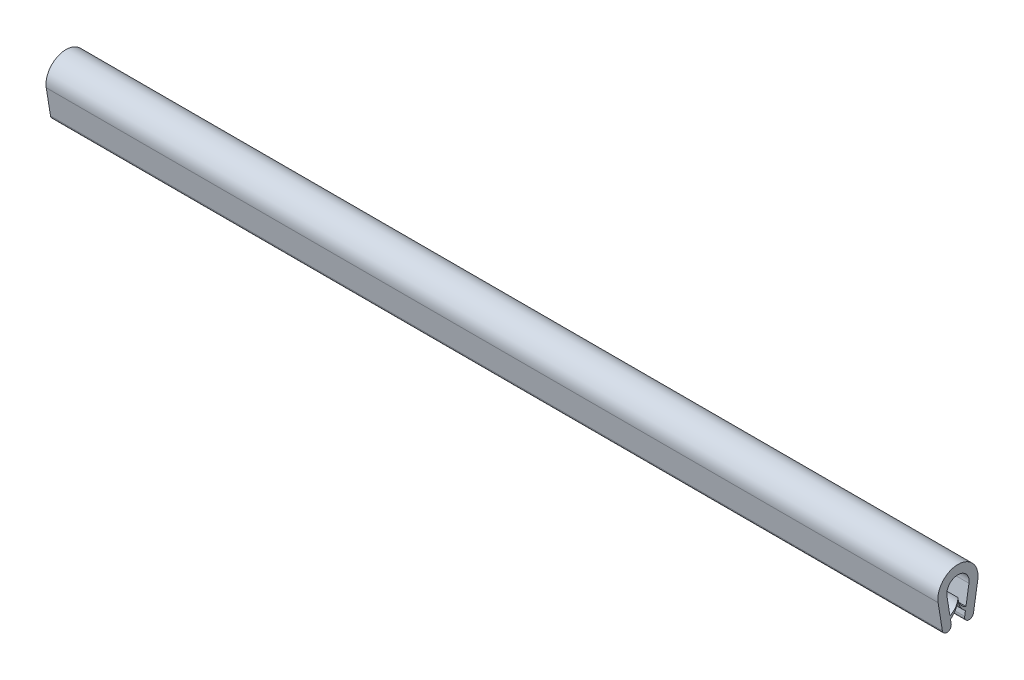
ISO-10303-21;
HEADER;
FILE_DESCRIPTION(('STEP AP214'),'2;1');
FILE_NAME('part.step','',(''),(''),'','','');
FILE_SCHEMA(('AUTOMOTIVE_DESIGN { 1 0 10303 214 1 1 1 1 }'));
ENDSEC;
DATA;
#1=APPLICATION_CONTEXT('core data for automotive mechanical design processes');
#2=APPLICATION_PROTOCOL_DEFINITION('international standard','automotive_design',2000,#1);
#3=PRODUCT_CONTEXT('',#1,'mechanical');
#4=PRODUCT('Part','Part','',(#3));
#5=PRODUCT_RELATED_PRODUCT_CATEGORY('part','',(#4));
#6=PRODUCT_DEFINITION_FORMATION('','',#4);
#7=PRODUCT_DEFINITION_CONTEXT('part definition',#1,'design');
#8=PRODUCT_DEFINITION('design','',#6,#7);
#9=PRODUCT_DEFINITION_SHAPE('','',#8);
#10=(LENGTH_UNIT() NAMED_UNIT(*) SI_UNIT(.MILLI.,.METRE.));
#11=(NAMED_UNIT(*) PLANE_ANGLE_UNIT() SI_UNIT($,.RADIAN.));
#12=(NAMED_UNIT(*) SI_UNIT($,.STERADIAN.) SOLID_ANGLE_UNIT());
#13=UNCERTAINTY_MEASURE_WITH_UNIT(LENGTH_MEASURE(1.E-05),#10,'distance_accuracy_value','');
#14=(GEOMETRIC_REPRESENTATION_CONTEXT(3) GLOBAL_UNCERTAINTY_ASSIGNED_CONTEXT((#13)) GLOBAL_UNIT_ASSIGNED_CONTEXT((#10,
#11,#12)) REPRESENTATION_CONTEXT('',''));
#15=CARTESIAN_POINT('',(0.,0.,0.));
#16=DIRECTION('',(0.,0.,1.));
#17=DIRECTION('',(1.,0.,0.));
#18=AXIS2_PLACEMENT_3D('',#15,#16,#17);
#19=CARTESIAN_POINT('',(200.,-4.93444739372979,2.76221040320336));
#20=DIRECTION('',(-1.,0.,0.));
#21=DIRECTION('',(0.,0.,1.));
#22=AXIS2_PLACEMENT_3D('',#19,#20,#21);
#23=CYLINDRICAL_SURFACE('',#22,1.00000000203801);
#24=CARTESIAN_POINT('',(0.,-4.93444739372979,2.76221040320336));
#25=DIRECTION('',(1.,0.,0.));
#26=DIRECTION('',(0.,0.,-1.));
#27=AXIS2_PLACEMENT_3D('',#24,#25,#26);
#28=CIRCLE('',#27,1.00000000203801);
#29=CARTESIAN_POINT('',(0.,-5.09316918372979,3.74953375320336));
#30=VERTEX_POINT('',#29);
#31=CARTESIAN_POINT('',(0.,-4.77572560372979,1.77488705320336));
#32=VERTEX_POINT('',#31);
#33=EDGE_CURVE('E239',#30,#32,#28,.T.);
#34=ORIENTED_EDGE('',*,*,#33,.T.);
#35=DIRECTION('',(-1.,0.,0.));
#36=VECTOR('',#35,1.);
#37=CARTESIAN_POINT('',(200.,-4.77572560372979,1.77488705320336));
#38=LINE('',#37,#36);
#39=CARTESIAN_POINT('',(200.,-4.77572560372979,1.77488705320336));
#40=VERTEX_POINT('',#39);
#41=EDGE_CURVE('E12',#40,#32,#38,.T.);
#42=ORIENTED_EDGE('',*,*,#41,.F.);
#43=CARTESIAN_POINT('',(200.,-4.93444739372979,2.76221040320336));
#44=DIRECTION('',(1.,0.,0.));
#45=DIRECTION('',(0.,0.,-1.));
#46=AXIS2_PLACEMENT_3D('',#43,#44,#45);
#47=CIRCLE('',#46,1.00000000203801);
#48=CARTESIAN_POINT('',(200.,-5.09316918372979,3.74953375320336));
#49=VERTEX_POINT('',#48);
#50=EDGE_CURVE('E328',#49,#40,#47,.T.);
#51=ORIENTED_EDGE('',*,*,#50,.F.);
#52=DIRECTION('',(-1.,0.,0.));
#53=VECTOR('',#52,1.);
#54=CARTESIAN_POINT('',(200.,-5.09316918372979,3.74953375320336));
#55=LINE('',#54,#53);
#56=EDGE_CURVE('E265',#49,#30,#55,.T.);
#57=ORIENTED_EDGE('',*,*,#56,.T.);
#58=EDGE_LOOP('',(#34,#42,#51,#57));
#59=FACE_BOUND('',#58,.T.);
#60=ADVANCED_FACE('F79',(#59),#23,.T.);
#61=CARTESIAN_POINT('',(200.,-4.77572560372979,1.77488705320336));
#62=DIRECTION('',(0.,-0.158721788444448,0.98732334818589));
#63=DIRECTION('',(0.,-0.98732334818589,-0.158721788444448));
#64=AXIS2_PLACEMENT_3D('',#61,#62,#63);
#65=PLANE('',#64);
#66=DIRECTION('',(0.,0.98732334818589,0.158721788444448));
#67=VECTOR('',#66,1.);
#68=CARTESIAN_POINT('',(0.,-4.77572560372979,1.77488705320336));
#69=LINE('',#68,#67);
#70=CARTESIAN_POINT('',(0.,-3.74018810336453,1.9413597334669));
#71=VERTEX_POINT('',#70);
#72=EDGE_CURVE('E243',#32,#71,#69,.T.);
#73=ORIENTED_EDGE('',*,*,#72,.T.);
#74=DIRECTION('',(-1.,0.,0.));
#75=VECTOR('',#74,1.);
#76=CARTESIAN_POINT('',(200.,-3.74018810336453,1.9413597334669));
#77=LINE('',#76,#75);
#78=CARTESIAN_POINT('',(200.,-3.74018810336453,1.9413597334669));
#79=VERTEX_POINT('',#78);
#80=EDGE_CURVE('E90',#79,#71,#77,.T.);
#81=ORIENTED_EDGE('',*,*,#80,.F.);
#82=DIRECTION('',(0.,0.98732334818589,0.158721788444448));
#83=VECTOR('',#82,1.);
#84=CARTESIAN_POINT('',(200.,-4.77572560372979,1.77488705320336));
#85=LINE('',#84,#83);
#86=EDGE_CURVE('E335',#40,#79,#85,.T.);
#87=ORIENTED_EDGE('',*,*,#86,.F.);
#88=ORIENTED_EDGE('',*,*,#41,.T.);
#89=EDGE_LOOP('',(#73,#81,#87,#88));
#90=FACE_BOUND('',#89,.T.);
#91=ADVANCED_FACE('F376',(#90),#65,.F.);
#92=CARTESIAN_POINT('',(200.,-0.454415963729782,4.31199086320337));
#93=DIRECTION('',(-1.,0.,0.));
#94=DIRECTION('',(0.,0.,1.));
#95=AXIS2_PLACEMENT_3D('',#92,#93,#94);
#96=CYLINDRICAL_SURFACE('',#95,4.05168983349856);
#97=CARTESIAN_POINT('',(0.,-0.454415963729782,4.31199086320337));
#98=DIRECTION('',(1.,0.,0.));
#99=DIRECTION('',(0.,0.,-1.));
#100=AXIS2_PLACEMENT_3D('',#97,#98,#99);
#101=CIRCLE('',#100,4.05168983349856);
#102=CARTESIAN_POINT('',(0.,-0.578789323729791,0.262210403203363));
#103=VERTEX_POINT('',#102);
#104=EDGE_CURVE('E246',#71,#103,#101,.T.);
#105=ORIENTED_EDGE('',*,*,#104,.T.);
#106=DIRECTION('',(-1.,0.,0.));
#107=VECTOR('',#106,1.);
#108=CARTESIAN_POINT('',(200.,-0.578789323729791,0.262210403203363));
#109=LINE('',#108,#107);
#110=CARTESIAN_POINT('',(200.,-0.578789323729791,0.262210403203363));
#111=VERTEX_POINT('',#110);
#112=EDGE_CURVE('E280',#111,#103,#109,.T.);
#113=ORIENTED_EDGE('',*,*,#112,.F.);
#114=CARTESIAN_POINT('',(200.,-0.454415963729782,4.31199086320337));
#115=DIRECTION('',(1.,0.,0.));
#116=DIRECTION('',(0.,0.,-1.));
#117=AXIS2_PLACEMENT_3D('',#114,#115,#116);
#118=CIRCLE('',#117,4.05168983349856);
#119=EDGE_CURVE('E338',#79,#111,#118,.T.);
#120=ORIENTED_EDGE('',*,*,#119,.F.);
#121=ORIENTED_EDGE('',*,*,#80,.T.);
#122=EDGE_LOOP('',(#105,#113,#120,#121));
#123=FACE_BOUND('',#122,.T.);
#124=ADVANCED_FACE('F381',(#123),#96,.T.);
#125=CARTESIAN_POINT('',(200.,-0.454415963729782,-3.78757005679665));
#126=DIRECTION('',(-1.,0.,0.));
#127=DIRECTION('',(0.,0.,1.));
#128=AXIS2_PLACEMENT_3D('',#125,#126,#127);
#129=CYLINDRICAL_SURFACE('',#128,4.05168983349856);
#130=CARTESIAN_POINT('',(0.,-0.454415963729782,-3.78757005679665));
#131=DIRECTION('',(1.,0.,0.));
#132=DIRECTION('',(0.,0.,-1.));
#133=AXIS2_PLACEMENT_3D('',#130,#131,#132);
#134=CIRCLE('',#133,4.05168983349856);
#135=CARTESIAN_POINT('',(0.,-3.74018810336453,-1.41693892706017));
#136=VERTEX_POINT('',#135);
#137=EDGE_CURVE('E249',#103,#136,#134,.T.);
#138=ORIENTED_EDGE('',*,*,#137,.T.);
#139=DIRECTION('',(-1.,0.,0.));
#140=VECTOR('',#139,1.);
#141=CARTESIAN_POINT('',(200.,-3.74018810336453,-1.41693892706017));
#142=LINE('',#141,#140);
#143=CARTESIAN_POINT('',(200.,-3.74018810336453,-1.41693892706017));
#144=VERTEX_POINT('',#143);
#145=EDGE_CURVE('E276',#144,#136,#142,.T.);
#146=ORIENTED_EDGE('',*,*,#145,.F.);
#147=CARTESIAN_POINT('',(200.,-0.454415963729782,-3.78757005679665));
#148=DIRECTION('',(1.,0.,0.));
#149=DIRECTION('',(0.,0.,-1.));
#150=AXIS2_PLACEMENT_3D('',#147,#148,#149);
#151=CIRCLE('',#150,4.05168983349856);
#152=EDGE_CURVE('E341',#111,#144,#151,.T.);
#153=ORIENTED_EDGE('',*,*,#152,.F.);
#154=ORIENTED_EDGE('',*,*,#112,.T.);
#155=EDGE_LOOP('',(#138,#146,#153,#154));
#156=FACE_BOUND('',#155,.T.);
#157=ADVANCED_FACE('F405',(#156),#129,.T.);
#158=CARTESIAN_POINT('',(200.,-3.74018810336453,-1.41693892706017));
#159=DIRECTION('',(0.,-0.158721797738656,-0.987323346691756));
#160=DIRECTION('',(0.,0.987323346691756,-0.158721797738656));
#161=AXIS2_PLACEMENT_3D('',#158,#159,#160);
#162=PLANE('',#161);
#163=DIRECTION('',(0.,-0.987323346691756,0.158721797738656));
#164=VECTOR('',#163,1.);
#165=CARTESIAN_POINT('',(0.,-3.74018810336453,-1.41693892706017));
#166=LINE('',#165,#164);
#167=CARTESIAN_POINT('',(0.,-4.77572560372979,-1.25046623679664));
#168=VERTEX_POINT('',#167);
#169=EDGE_CURVE('E252',#136,#168,#166,.T.);
#170=ORIENTED_EDGE('',*,*,#169,.T.);
#171=DIRECTION('',(-1.,0.,0.));
#172=VECTOR('',#171,1.);
#173=CARTESIAN_POINT('',(200.,-4.77572560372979,-1.25046623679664));
#174=LINE('',#173,#172);
#175=CARTESIAN_POINT('',(200.,-4.77572560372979,-1.25046623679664));
#176=VERTEX_POINT('',#175);
#177=EDGE_CURVE('E272',#176,#168,#174,.T.);
#178=ORIENTED_EDGE('',*,*,#177,.F.);
#179=DIRECTION('',(0.,-0.987323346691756,0.158721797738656));
#180=VECTOR('',#179,1.);
#181=CARTESIAN_POINT('',(200.,-3.74018810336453,-1.41693892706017));
#182=LINE('',#181,#180);
#183=EDGE_CURVE('E344',#144,#176,#182,.T.);
#184=ORIENTED_EDGE('',*,*,#183,.F.);
#185=ORIENTED_EDGE('',*,*,#145,.T.);
#186=EDGE_LOOP('',(#170,#178,#184,#185));
#187=FACE_BOUND('',#186,.T.);
#188=ADVANCED_FACE('F352',(#187),#162,.F.);
#189=CARTESIAN_POINT('',(200.,-4.93444739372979,-2.23778958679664));
#190=DIRECTION('',(-1.,0.,0.));
#191=DIRECTION('',(0.,0.,1.));
#192=AXIS2_PLACEMENT_3D('',#189,#190,#191);
#193=CYLINDRICAL_SURFACE('',#192,1.00000000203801);
#194=CARTESIAN_POINT('',(0.,-4.93444739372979,-2.23778958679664));
#195=DIRECTION('',(1.,0.,0.));
#196=DIRECTION('',(0.,0.,-1.));
#197=AXIS2_PLACEMENT_3D('',#194,#195,#196);
#198=CIRCLE('',#197,1.00000000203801);
#199=CARTESIAN_POINT('',(0.,-5.09316918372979,-3.22511293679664));
#200=VERTEX_POINT('',#199);
#201=EDGE_CURVE('E255',#168,#200,#198,.T.);
#202=ORIENTED_EDGE('',*,*,#201,.T.);
#203=DIRECTION('',(-1.,0.,0.));
#204=VECTOR('',#203,1.);
#205=CARTESIAN_POINT('',(200.,-5.09316918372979,-3.22511293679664));
#206=LINE('',#205,#204);
#207=CARTESIAN_POINT('',(200.,-5.09316918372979,-3.22511293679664));
#208=VERTEX_POINT('',#207);
#209=EDGE_CURVE('E209',#208,#200,#206,.T.);
#210=ORIENTED_EDGE('',*,*,#209,.F.);
#211=CARTESIAN_POINT('',(200.,-4.93444739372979,-2.23778958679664));
#212=DIRECTION('',(1.,0.,0.));
#213=DIRECTION('',(0.,0.,-1.));
#214=AXIS2_PLACEMENT_3D('',#211,#212,#213);
#215=CIRCLE('',#214,1.00000000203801);
#216=EDGE_CURVE('E197',#176,#208,#215,.T.);
#217=ORIENTED_EDGE('',*,*,#216,.F.);
#218=ORIENTED_EDGE('',*,*,#177,.T.);
#219=EDGE_LOOP('',(#202,#210,#217,#218));
#220=FACE_BOUND('',#219,.T.);
#221=ADVANCED_FACE('F356',(#220),#193,.T.);
#222=CARTESIAN_POINT('',(200.,-5.09316918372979,-3.22511293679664));
#223=DIRECTION('',(0.,0.158721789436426,0.98732334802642));
#224=DIRECTION('',(0.,-0.98732334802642,0.158721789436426));
#225=AXIS2_PLACEMENT_3D('',#222,#223,#224);
#226=PLANE('',#225);
#227=DIRECTION('',(0.,0.98732334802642,-0.158721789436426));
#228=VECTOR('',#227,1.);
#229=CARTESIAN_POINT('',(0.,-5.09316918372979,-3.22511293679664));
#230=LINE('',#229,#228);
#231=CARTESIAN_POINT('',(0.,0.851304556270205,-4.18074465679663));
#232=VERTEX_POINT('',#231);
#233=EDGE_CURVE('E207',#200,#232,#230,.T.);
#234=ORIENTED_EDGE('',*,*,#233,.T.);
#235=DIRECTION('',(-1.,0.,0.));
#236=VECTOR('',#235,1.);
#237=CARTESIAN_POINT('',(200.,0.851304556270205,-4.18074465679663));
#238=LINE('',#237,#236);
#239=CARTESIAN_POINT('',(200.,0.851304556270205,-4.18074465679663));
#240=VERTEX_POINT('',#239);
#241=EDGE_CURVE('E204',#240,#232,#238,.T.);
#242=ORIENTED_EDGE('',*,*,#241,.F.);
#243=DIRECTION('',(0.,0.98732334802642,-0.158721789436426));
#244=VECTOR('',#243,1.);
#245=CARTESIAN_POINT('',(200.,-5.09316918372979,-3.22511293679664));
#246=LINE('',#245,#244);
#247=EDGE_CURVE('E191',#208,#240,#246,.T.);
#248=ORIENTED_EDGE('',*,*,#247,.F.);
#249=ORIENTED_EDGE('',*,*,#209,.T.);
#250=EDGE_LOOP('',(#234,#242,#248,#249));
#251=FACE_BOUND('',#250,.T.);
#252=ADVANCED_FACE('F205',(#251),#226,.F.);
#253=CARTESIAN_POINT('',(200.,1.56555260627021,0.262210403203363));
#254=DIRECTION('',(-1.,0.,0.));
#255=DIRECTION('',(0.,0.,1.));
#256=AXIS2_PLACEMENT_3D('',#253,#254,#255);
#257=CYLINDRICAL_SURFACE('',#256,4.50000000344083);
#258=CARTESIAN_POINT('',(0.,1.56555260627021,0.262210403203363));
#259=DIRECTION('',(1.,0.,0.));
#260=DIRECTION('',(0.,0.,-1.));
#261=AXIS2_PLACEMENT_3D('',#258,#259,#260);
#262=CIRCLE('',#261,4.50000000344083);
#263=CARTESIAN_POINT('',(0.,0.851304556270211,4.70516547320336));
#264=VERTEX_POINT('',#263);
#265=EDGE_CURVE('E145',#232,#264,#262,.T.);
#266=ORIENTED_EDGE('',*,*,#265,.T.);
#267=DIRECTION('',(-1.,0.,0.));
#268=VECTOR('',#267,1.);
#269=CARTESIAN_POINT('',(200.,0.851304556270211,4.70516547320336));
#270=LINE('',#269,#268);
#271=CARTESIAN_POINT('',(200.,0.851304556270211,4.70516547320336));
#272=VERTEX_POINT('',#271);
#273=EDGE_CURVE('E210',#272,#264,#270,.T.);
#274=ORIENTED_EDGE('',*,*,#273,.F.);
#275=CARTESIAN_POINT('',(200.,1.56555260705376,0.262210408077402));
#276=DIRECTION('',(1.,0.,0.));
#277=DIRECTION('',(0.,0.,-1.));
#278=AXIS2_PLACEMENT_3D('',#275,#276,#277);
#279=CIRCLE('',#278,4.49999999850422);
#280=EDGE_CURVE('E195',#240,#272,#279,.T.);
#281=ORIENTED_EDGE('',*,*,#280,.F.);
#282=ORIENTED_EDGE('',*,*,#241,.T.);
#283=EDGE_LOOP('',(#266,#274,#281,#282));
#284=FACE_BOUND('',#283,.T.);
#285=ADVANCED_FACE('F212',(#284),#257,.T.);
#286=CARTESIAN_POINT('',(200.,-0.288337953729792,3.22005680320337));
#287=DIRECTION('',(-1.,0.,0.));
#288=DIRECTION('',(0.,0.,1.));
#289=AXIS2_PLACEMENT_3D('',#286,#287,#288);
#290=CYLINDRICAL_SURFACE('',#289,2.95922909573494);
#291=CARTESIAN_POINT('',(0.,-0.288337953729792,3.22005680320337));
#292=DIRECTION('',(1.,0.,0.));
#293=DIRECTION('',(0.,0.,-1.));
#294=AXIS2_PLACEMENT_3D('',#291,#292,#293);
#295=CIRCLE('',#294,2.95922909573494);
#296=CARTESIAN_POINT('',(0.,-3.01016269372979,2.05871838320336));
#297=VERTEX_POINT('',#296);
#298=CARTESIAN_POINT('',(0.,-0.378789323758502,0.262210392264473));
#299=VERTEX_POINT('',#298);
#300=EDGE_CURVE('E220',#297,#299,#295,.T.);
#301=ORIENTED_EDGE('',*,*,#300,.F.);
#302=DIRECTION('',(-1.,0.,0.));
#303=VECTOR('',#302,1.);
#304=CARTESIAN_POINT('',(200.,-3.01016269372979,2.05871838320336));
#305=LINE('',#304,#303);
#306=CARTESIAN_POINT('',(200.,-3.01016269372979,2.05871838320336));
#307=VERTEX_POINT('',#306);
#308=EDGE_CURVE('E83',#307,#297,#305,.T.);
#309=ORIENTED_EDGE('',*,*,#308,.F.);
#310=CARTESIAN_POINT('',(200.,-0.288337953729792,3.22005680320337));
#311=DIRECTION('',(1.,0.,0.));
#312=DIRECTION('',(0.,0.,-1.));
#313=AXIS2_PLACEMENT_3D('',#310,#311,#312);
#314=CIRCLE('',#313,2.95922909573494);
#315=CARTESIAN_POINT('',(200.,-0.378789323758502,0.262210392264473));
#316=VERTEX_POINT('',#315);
#317=EDGE_CURVE('E264',#307,#316,#314,.T.);
#318=ORIENTED_EDGE('',*,*,#317,.T.);
#319=DIRECTION('',(-1.,0.,0.));
#320=VECTOR('',#319,1.);
#321=CARTESIAN_POINT('',(200.,-0.378789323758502,0.262210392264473));
#322=LINE('',#321,#320);
#323=EDGE_CURVE('E216',#316,#299,#322,.T.);
#324=ORIENTED_EDGE('',*,*,#323,.T.);
#325=EDGE_LOOP('',(#301,#309,#318,#324));
#326=FACE_BOUND('',#325,.T.);
#327=ADVANCED_FACE('F81',(#326),#290,.F.);
#328=CARTESIAN_POINT('',(200.,1.16874813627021,2.73051877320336));
#329=DIRECTION('',(0.,0.158721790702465,-0.987323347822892));
#330=DIRECTION('',(0.,0.987323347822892,0.158721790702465));
#331=AXIS2_PLACEMENT_3D('',#328,#329,#330);
#332=PLANE('',#331);
#333=DIRECTION('',(0.,-0.987323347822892,-0.158721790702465));
#334=VECTOR('',#333,1.);
#335=CARTESIAN_POINT('',(0.,1.16874813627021,2.73051877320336));
#336=LINE('',#335,#334);
#337=CARTESIAN_POINT('',(0.,1.16874813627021,2.73051877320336));
#338=VERTEX_POINT('',#337);
#339=EDGE_CURVE('E224',#338,#297,#336,.T.);
#340=ORIENTED_EDGE('',*,*,#339,.F.);
#341=DIRECTION('',(-1.,0.,0.));
#342=VECTOR('',#341,1.);
#343=CARTESIAN_POINT('',(200.,1.16874813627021,2.73051877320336));
#344=LINE('',#343,#342);
#345=CARTESIAN_POINT('',(200.,1.16874813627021,2.73051877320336));
#346=VERTEX_POINT('',#345);
#347=EDGE_CURVE('E294',#346,#338,#344,.T.);
#348=ORIENTED_EDGE('',*,*,#347,.F.);
#349=DIRECTION('',(0.,-0.987323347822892,-0.158721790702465));
#350=VECTOR('',#349,1.);
#351=CARTESIAN_POINT('',(200.,1.16874813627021,2.73051877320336));
#352=LINE('',#351,#350);
#353=EDGE_CURVE('E306',#346,#307,#352,.T.);
#354=ORIENTED_EDGE('',*,*,#353,.T.);
#355=ORIENTED_EDGE('',*,*,#308,.T.);
#356=EDGE_LOOP('',(#340,#348,#354,#355));
#357=FACE_BOUND('',#356,.T.);
#358=ADVANCED_FACE('F304',(#357),#332,.T.);
#359=CARTESIAN_POINT('',(200.,1.56555260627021,0.262210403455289));
#360=DIRECTION('',(-1.,0.,0.));
#361=DIRECTION('',(0.,0.,1.));
#362=AXIS2_PLACEMENT_3D('',#359,#360,#361);
#363=CYLINDRICAL_SURFACE('',#362,2.49999999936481);
#364=CARTESIAN_POINT('',(0.,1.56555260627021,0.262210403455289));
#365=DIRECTION('',(1.,0.,0.));
#366=DIRECTION('',(0.,0.,-1.));
#367=AXIS2_PLACEMENT_3D('',#364,#365,#366);
#368=CIRCLE('',#367,2.49999999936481);
#369=CARTESIAN_POINT('',(0.,1.1687481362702,-2.20609796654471));
#370=VERTEX_POINT('',#369);
#371=EDGE_CURVE('E228',#370,#338,#368,.T.);
#372=ORIENTED_EDGE('',*,*,#371,.F.);
#373=DIRECTION('',(-1.,0.,0.));
#374=VECTOR('',#373,1.);
#375=CARTESIAN_POINT('',(200.,1.1687481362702,-2.20609796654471));
#376=LINE('',#375,#374);
#377=CARTESIAN_POINT('',(200.,1.1687481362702,-2.20609796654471));
#378=VERTEX_POINT('',#377);
#379=EDGE_CURVE('E292',#378,#370,#376,.T.);
#380=ORIENTED_EDGE('',*,*,#379,.F.);
#381=CARTESIAN_POINT('',(200.,1.56555260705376,0.262210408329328));
#382=DIRECTION('',(1.,0.,0.));
#383=DIRECTION('',(0.,0.,-1.));
#384=AXIS2_PLACEMENT_3D('',#381,#382,#383);
#385=CIRCLE('',#384,2.49999999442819);
#386=EDGE_CURVE('E315',#378,#346,#385,.T.);
#387=ORIENTED_EDGE('',*,*,#386,.T.);
#388=ORIENTED_EDGE('',*,*,#347,.T.);
#389=EDGE_LOOP('',(#372,#380,#387,#388));
#390=FACE_BOUND('',#389,.T.);
#391=ADVANCED_FACE('F313',(#390),#363,.F.);
#392=CARTESIAN_POINT('',(200.,-3.01016269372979,-1.53429758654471));
#393=DIRECTION('',(0.,0.158721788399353,0.987323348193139));
#394=DIRECTION('',(0.,-0.987323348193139,0.158721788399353));
#395=AXIS2_PLACEMENT_3D('',#392,#393,#394);
#396=PLANE('',#395);
#397=DIRECTION('',(0.,0.987323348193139,-0.158721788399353));
#398=VECTOR('',#397,1.);
#399=CARTESIAN_POINT('',(0.,-3.01016269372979,-1.53429758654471));
#400=LINE('',#399,#398);
#401=CARTESIAN_POINT('',(0.,-3.01016269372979,-1.53429758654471));
#402=VERTEX_POINT('',#401);
#403=EDGE_CURVE('E231',#402,#370,#400,.T.);
#404=ORIENTED_EDGE('',*,*,#403,.F.);
#405=DIRECTION('',(-1.,0.,0.));
#406=VECTOR('',#405,1.);
#407=CARTESIAN_POINT('',(200.,-3.01016269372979,-1.53429758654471));
#408=LINE('',#407,#406);
#409=CARTESIAN_POINT('',(200.,-3.01016269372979,-1.53429758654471));
#410=VERTEX_POINT('',#409);
#411=EDGE_CURVE('E289',#410,#402,#408,.T.);
#412=ORIENTED_EDGE('',*,*,#411,.F.);
#413=DIRECTION('',(0.,0.987323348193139,-0.158721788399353));
#414=VECTOR('',#413,1.);
#415=CARTESIAN_POINT('',(200.,-3.01016269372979,-1.53429758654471));
#416=LINE('',#415,#414);
#417=EDGE_CURVE('E318',#410,#378,#416,.T.);
#418=ORIENTED_EDGE('',*,*,#417,.T.);
#419=ORIENTED_EDGE('',*,*,#379,.T.);
#420=EDGE_LOOP('',(#404,#412,#418,#419));
#421=FACE_BOUND('',#420,.T.);
#422=ADVANCED_FACE('F319',(#421),#396,.T.);
#423=CARTESIAN_POINT('',(200.,-0.288337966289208,-2.6956360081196));
#424=DIRECTION('',(-1.,0.,0.));
#425=DIRECTION('',(0.,0.,1.));
#426=AXIS2_PLACEMENT_3D('',#423,#424,#425);
#427=CYLINDRICAL_SURFACE('',#426,2.95922908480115);
#428=CARTESIAN_POINT('',(0.,-0.288337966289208,-2.6956360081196));
#429=DIRECTION('',(1.,0.,0.));
#430=DIRECTION('',(0.,0.,-1.));
#431=AXIS2_PLACEMENT_3D('',#428,#429,#430);
#432=CIRCLE('',#431,2.95922908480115);
#433=EDGE_CURVE('E235',#299,#402,#432,.T.);
#434=ORIENTED_EDGE('',*,*,#433,.F.);
#435=ORIENTED_EDGE('',*,*,#323,.F.);
#436=CARTESIAN_POINT('',(200.,-0.288337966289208,-2.6956360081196));
#437=DIRECTION('',(1.,0.,0.));
#438=DIRECTION('',(0.,0.,-1.));
#439=AXIS2_PLACEMENT_3D('',#436,#437,#438);
#440=CIRCLE('',#439,2.95922908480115);
#441=EDGE_CURVE('E324',#316,#410,#440,.T.);
#442=ORIENTED_EDGE('',*,*,#441,.T.);
#443=ORIENTED_EDGE('',*,*,#411,.T.);
#444=EDGE_LOOP('',(#434,#435,#442,#443));
#445=FACE_BOUND('',#444,.T.);
#446=ADVANCED_FACE('F364',(#445),#427,.F.);
#447=CARTESIAN_POINT('',(200.,0.851304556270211,4.70516547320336));
#448=DIRECTION('',(0.,0.158721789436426,-0.98732334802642));
#449=DIRECTION('',(0.,0.98732334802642,0.158721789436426));
#450=AXIS2_PLACEMENT_3D('',#447,#448,#449);
#451=PLANE('',#450);
#452=DIRECTION('',(0.,-0.98732334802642,-0.158721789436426));
#453=VECTOR('',#452,1.);
#454=CARTESIAN_POINT('',(0.,0.851304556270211,4.70516547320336));
#455=LINE('',#454,#453);
#456=EDGE_CURVE('E151',#264,#30,#455,.T.);
#457=ORIENTED_EDGE('',*,*,#456,.T.);
#458=ORIENTED_EDGE('',*,*,#56,.F.);
#459=DIRECTION('',(0.,-0.98732334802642,-0.158721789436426));
#460=VECTOR('',#459,1.);
#461=CARTESIAN_POINT('',(200.,0.851304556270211,4.70516547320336));
#462=LINE('',#461,#460);
#463=EDGE_CURVE('E99',#272,#49,#462,.T.);
#464=ORIENTED_EDGE('',*,*,#463,.F.);
#465=ORIENTED_EDGE('',*,*,#273,.T.);
#466=EDGE_LOOP('',(#457,#458,#464,#465));
#467=FACE_BOUND('',#466,.T.);
#468=ADVANCED_FACE('F362',(#467),#451,.F.);
#469=CARTESIAN_POINT('',(200.,-4.93444739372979,2.76221040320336));
#470=DIRECTION('',(1.,0.,0.));
#471=DIRECTION('',(0.,0.,-1.));
#472=AXIS2_PLACEMENT_3D('',#469,#470,#471);
#473=PLANE('',#472);
#474=ORIENTED_EDGE('',*,*,#317,.F.);
#475=ORIENTED_EDGE('',*,*,#353,.F.);
#476=ORIENTED_EDGE('',*,*,#386,.F.);
#477=ORIENTED_EDGE('',*,*,#417,.F.);
#478=ORIENTED_EDGE('',*,*,#441,.F.);
#479=EDGE_LOOP('',(#474,#475,#476,#477,#478));
#480=FACE_BOUND('',#479,.T.);
#481=ORIENTED_EDGE('',*,*,#50,.T.);
#482=ORIENTED_EDGE('',*,*,#86,.T.);
#483=ORIENTED_EDGE('',*,*,#119,.T.);
#484=ORIENTED_EDGE('',*,*,#152,.T.);
#485=ORIENTED_EDGE('',*,*,#183,.T.);
#486=ORIENTED_EDGE('',*,*,#216,.T.);
#487=ORIENTED_EDGE('',*,*,#247,.T.);
#488=ORIENTED_EDGE('',*,*,#280,.T.);
#489=ORIENTED_EDGE('',*,*,#463,.T.);
#490=EDGE_LOOP('',(#481,#482,#483,#484,#485,#486,#487,#488,#489));
#491=FACE_BOUND('',#490,.T.);
#492=ADVANCED_FACE('F193',(#480,#491),#473,.T.);
#493=CARTESIAN_POINT('',(0.,-4.93444739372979,2.76221040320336));
#494=DIRECTION('',(1.,0.,0.));
#495=DIRECTION('',(0.,0.,-1.));
#496=AXIS2_PLACEMENT_3D('',#493,#494,#495);
#497=PLANE('',#496);
#498=ORIENTED_EDGE('',*,*,#300,.T.);
#499=ORIENTED_EDGE('',*,*,#433,.T.);
#500=ORIENTED_EDGE('',*,*,#403,.T.);
#501=ORIENTED_EDGE('',*,*,#371,.T.);
#502=ORIENTED_EDGE('',*,*,#339,.T.);
#503=EDGE_LOOP('',(#498,#499,#500,#501,#502));
#504=FACE_BOUND('',#503,.T.);
#505=ORIENTED_EDGE('',*,*,#33,.F.);
#506=ORIENTED_EDGE('',*,*,#456,.F.);
#507=ORIENTED_EDGE('',*,*,#265,.F.);
#508=ORIENTED_EDGE('',*,*,#233,.F.);
#509=ORIENTED_EDGE('',*,*,#201,.F.);
#510=ORIENTED_EDGE('',*,*,#169,.F.);
#511=ORIENTED_EDGE('',*,*,#137,.F.);
#512=ORIENTED_EDGE('',*,*,#104,.F.);
#513=ORIENTED_EDGE('',*,*,#72,.F.);
#514=EDGE_LOOP('',(#505,#506,#507,#508,#509,#510,#511,#512,#513));
#515=FACE_BOUND('',#514,.T.);
#516=ADVANCED_FACE('F309',(#504,#515),#497,.F.);
#517=CLOSED_SHELL('',(#60,#91,#124,#157,#188,#221,#252,#285,#327,#358,#391,#422,#446,#468,#492,#516));
#518=MANIFOLD_SOLID_BREP('B2',#517);
#519=ADVANCED_BREP_SHAPE_REPRESENTATION('',(#18,#518),#14);
#520=SHAPE_DEFINITION_REPRESENTATION(#9,#519);
ENDSEC;
END-ISO-10303-21;
